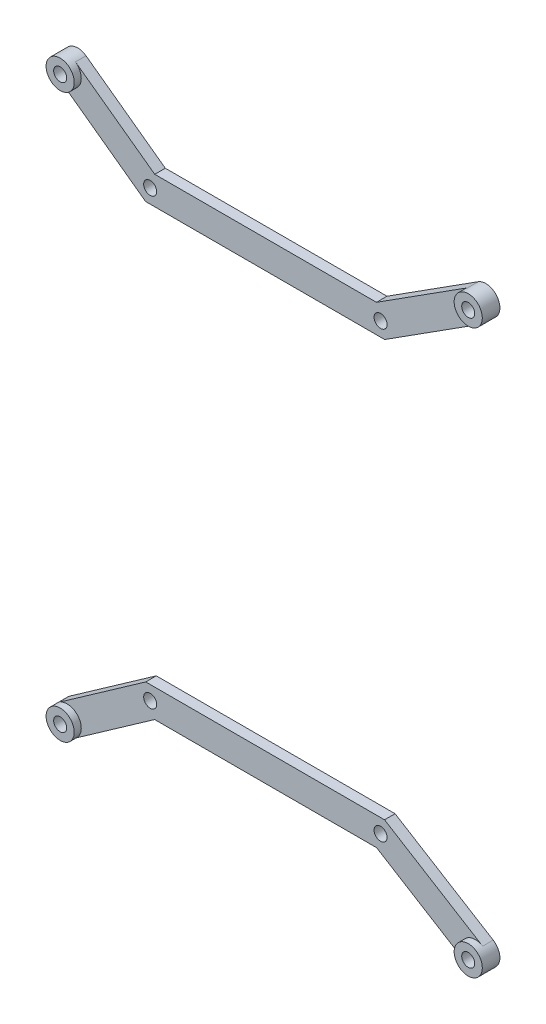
from build123d import *
from build123d.topology import SkipClean

# Parameters (mm, degrees)
SKIZZE1_R                         = 1.85
AUFSATZ_LINEAR_AUSTRAGEN1_DEPTH   = 3
AUFSATZ_LINEAR_AUSTRAGEN1_2_DEPTH = 3
AUFSATZ_LINEAR_START              = 2
SKIZZE5_R                         = 4
SKIZZE5_R_2                       = 1.85
AUFSATZ_LINEAR_AUSTRAGEN2_DEPTH   = 2


with BuildPart() as part:
    # Skizze1 → Aufsatz-Linear austragen1 (new body)
    with BuildSketch(Plane.XY):
        with BuildLine():
            Line((60.731599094, -75.234694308), (32.846204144, -58.05997824))
            Line((32.846204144, -58.05997824), (-35.041919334, -58.05997824))
            Line((-35.041919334, -58.05997824), (-59.666253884, -75.368052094))
            ThreePointArc((-59.666253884, -75.368052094), (-60.638558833, -80.940719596), (-55.065891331, -81.913024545))
            Line((-55.065891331, -81.913024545), (-32.511636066, -66.05997824))
            Line((-32.511636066, -66.05997824), (30.580240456, -66.05997824))
            Line((30.580240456, -66.05997824), (56.536255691, -82.046382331))
            ThreePointArc((56.536255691, -82.046382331), (62.039771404, -80.738210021), (60.731599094, -75.234694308))
        make_face()
        with Locations((-33.7767777, -62.05997824)):
            Circle(SKIZZE1_R, mode=Mode.SUBTRACT)
        with Locations((31.7132223, -62.05997824)):
            Circle(SKIZZE1_R, mode=Mode.SUBTRACT)
        with Locations((58.633927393, -78.640538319)):
            Circle(SKIZZE1_R, mode=Mode.SUBTRACT)
        with Locations((-57.366072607, -78.640538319)):
            Circle(SKIZZE1_R, mode=Mode.SUBTRACT)
    extrude(amount=-AUFSATZ_LINEAR_AUSTRAGEN1_DEPTH)



with BuildPart() as body_2:
    # Skizze1 → Aufsatz-Linear austragen1 2 (new body)
    with BuildSketch(Plane.XY):
        with BuildLine():
            Line((30.54623614, 68.19002176), (56.483030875, 84.731945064))
            ThreePointArc((56.483030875, 84.731945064), (62.006410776, 83.510358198), (60.78482391, 77.986978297))
            Line((60.78482391, 77.986978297), (32.88020846, 60.19002176))
            Line((32.88020846, 60.19002176), (-35.078346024, 60.19002176))
            Line((-35.078346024, 60.19002176), (-59.719977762, 78.125403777))
            ThreePointArc((-59.719977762, 78.125403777), (-60.600130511, 83.713366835), (-55.012167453, 84.593519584))
            Line((-55.012167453, 84.593519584), (-32.475209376, 68.19002176))
            Line((-32.475209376, 68.19002176), (30.54623614, 68.19002176))
        make_face()
        with Locations(Location((31.7132223, 64.19002176, 0), (0, 0, 180))):
            Circle(SKIZZE1_R, mode=Mode.SUBTRACT)
        with Locations(Location((-33.7767777, 64.19002176, 0), (0, 0, 180))):
            Circle(SKIZZE1_R, mode=Mode.SUBTRACT)
        with Locations((-57.366072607, 81.359461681)):
            Circle(SKIZZE1_R, mode=Mode.SUBTRACT)
        with Locations((58.633927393, 81.359461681)):
            Circle(SKIZZE1_R, mode=Mode.SUBTRACT)
    extrude(amount=-AUFSATZ_LINEAR_AUSTRAGEN1_2_DEPTH)


with BuildPart() as part_1:
    with SkipClean():  # the faces are left unmerged after this step: merging them gives an invalid solid
        add(part.part)

        add(body_2.part)  # Aufsatz-Linear austragen2 merges body 2
        # Skizze5 → Aufsatz-Linear austragen2 (add)
        # profile 1 of 4: a face of its own
        with BuildSketch(Plane.XY.offset(AUFSATZ_LINEAR_START)):
            with Locations((-57.366072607, -78.640538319)):
                Circle(SKIZZE5_R)
            with Locations((-57.366072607, -78.640538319)):
                Circle(SKIZZE5_R_2, mode=Mode.SUBTRACT)
        # profile 2 of 4: a face of its own
        with BuildSketch(Plane.XY.offset(AUFSATZ_LINEAR_START)):
            with Locations((58.633927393, -78.640538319)):
                Circle(SKIZZE5_R)
            with Locations((58.633927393, -78.640538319)):
                Circle(SKIZZE5_R_2, mode=Mode.SUBTRACT)
        # profile 3 of 4: a face of its own
        with BuildSketch(Plane.XY.offset(AUFSATZ_LINEAR_START)):
            with Locations((-57.366072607, 81.359461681)):
                Circle(SKIZZE5_R)
            with Locations((-57.366072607, 81.359461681)):
                Circle(SKIZZE5_R_2, mode=Mode.SUBTRACT)
        # profile 4 of 4: a face of its own
        with BuildSketch(Plane.XY.offset(AUFSATZ_LINEAR_START)):
            with Locations((58.633927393, 81.359461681)):
                Circle(SKIZZE5_R)
            with Locations((58.633927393, 81.359461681)):
                Circle(SKIZZE5_R_2, mode=Mode.SUBTRACT)
        extrude(amount=-AUFSATZ_LINEAR_AUSTRAGEN2_DEPTH)


solid = part_1.part
